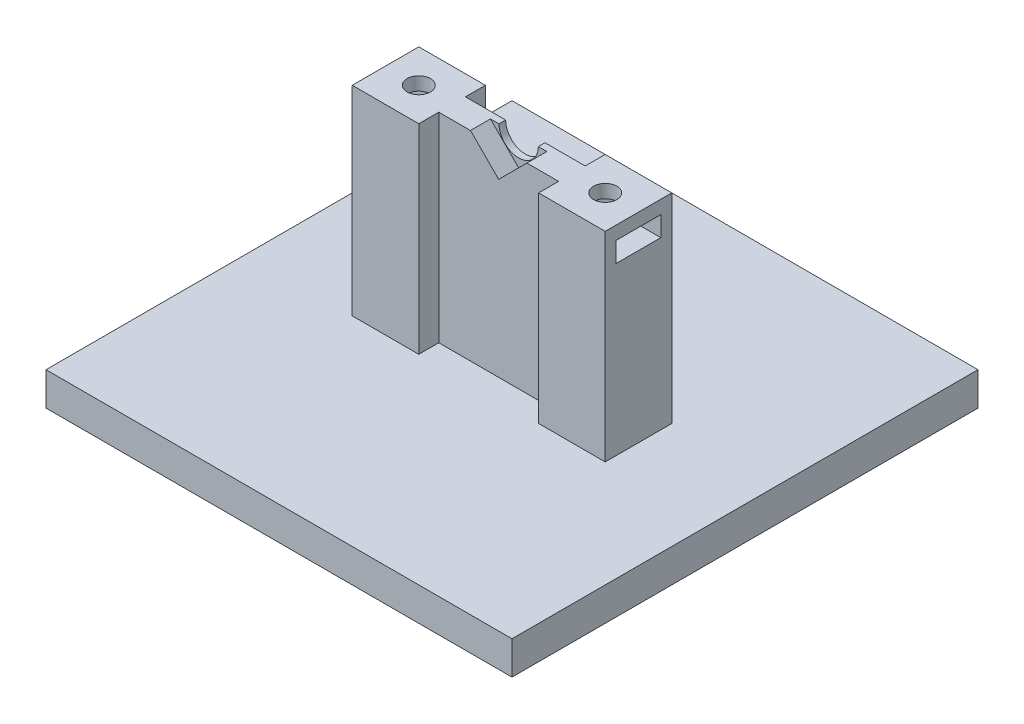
ISO-10303-21;
HEADER;
FILE_DESCRIPTION(('STEP AP214'),'2;1');
FILE_NAME('part.step','',(''),(''),'','','');
FILE_SCHEMA(('AUTOMOTIVE_DESIGN { 1 0 10303 214 1 1 1 1 }'));
ENDSEC;
DATA;
#1=APPLICATION_CONTEXT('core data for automotive mechanical design processes');
#2=APPLICATION_PROTOCOL_DEFINITION('international standard','automotive_design',2000,#1);
#3=PRODUCT_CONTEXT('',#1,'mechanical');
#4=PRODUCT('Part','Part','',(#3));
#5=PRODUCT_RELATED_PRODUCT_CATEGORY('part','',(#4));
#6=PRODUCT_DEFINITION_FORMATION('','',#4);
#7=PRODUCT_DEFINITION_CONTEXT('part definition',#1,'design');
#8=PRODUCT_DEFINITION('design','',#6,#7);
#9=PRODUCT_DEFINITION_SHAPE('','',#8);
#10=(LENGTH_UNIT() NAMED_UNIT(*) SI_UNIT(.MILLI.,.METRE.));
#11=(NAMED_UNIT(*) PLANE_ANGLE_UNIT() SI_UNIT($,.RADIAN.));
#12=(NAMED_UNIT(*) SI_UNIT($,.STERADIAN.) SOLID_ANGLE_UNIT());
#13=UNCERTAINTY_MEASURE_WITH_UNIT(LENGTH_MEASURE(1.E-05),#10,'distance_accuracy_value','');
#14=(GEOMETRIC_REPRESENTATION_CONTEXT(3) GLOBAL_UNCERTAINTY_ASSIGNED_CONTEXT((#13)) GLOBAL_UNIT_ASSIGNED_CONTEXT((#10,
#11,#12)) REPRESENTATION_CONTEXT('',''));
#15=CARTESIAN_POINT('',(0.,0.,0.));
#16=DIRECTION('',(0.,0.,1.));
#17=DIRECTION('',(1.,0.,0.));
#18=AXIS2_PLACEMENT_3D('',#15,#16,#17);
#19=CARTESIAN_POINT('',(0.,35.,0.));
#20=DIRECTION('',(0.,1.,0.));
#21=DIRECTION('',(0.,0.,1.));
#22=AXIS2_PLACEMENT_3D('',#19,#20,#21);
#23=PLANE('',#22);
#24=CARTESIAN_POINT('',(-14.,35.,0.));
#25=DIRECTION('',(0.,1.,0.));
#26=DIRECTION('',(0.,0.,1.));
#27=AXIS2_PLACEMENT_3D('',#24,#25,#26);
#28=CIRCLE('',#27,1.75);
#29=CARTESIAN_POINT('',(-14.,35.,1.75));
#30=VERTEX_POINT('',#29);
#31=EDGE_CURVE('E662',#30,#30,#28,.T.);
#32=ORIENTED_EDGE('',*,*,#31,.F.);
#33=EDGE_LOOP('',(#32));
#34=FACE_BOUND('',#33,.T.);
#35=DIRECTION('',(0.,0.,1.));
#36=VECTOR('',#35,1.);
#37=CARTESIAN_POINT('',(-2.95,35.,-35.));
#38=LINE('',#37,#36);
#39=CARTESIAN_POINT('',(-2.95,35.,-2.));
#40=VERTEX_POINT('',#39);
#41=CARTESIAN_POINT('',(-2.95,35.,-1.));
#42=VERTEX_POINT('',#41);
#43=EDGE_CURVE('E310',#40,#42,#38,.T.);
#44=ORIENTED_EDGE('',*,*,#43,.F.);
#45=DIRECTION('',(1.,0.,0.));
#46=VECTOR('',#45,1.);
#47=CARTESIAN_POINT('',(0.,35.,-2.));
#48=LINE('',#47,#46);
#49=CARTESIAN_POINT('',(-9.00000000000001,35.,-2.));
#50=VERTEX_POINT('',#49);
#51=EDGE_CURVE('E380',#50,#40,#48,.T.);
#52=ORIENTED_EDGE('',*,*,#51,.F.);
#53=DIRECTION('',(0.,0.,-1.));
#54=VECTOR('',#53,1.);
#55=CARTESIAN_POINT('',(-9.00000000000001,35.,0.));
#56=LINE('',#55,#54);
#57=CARTESIAN_POINT('',(-9.00000000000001,35.,-5.));
#58=VERTEX_POINT('',#57);
#59=EDGE_CURVE('E360',#50,#58,#56,.T.);
#60=ORIENTED_EDGE('',*,*,#59,.T.);
#61=DIRECTION('',(-1.,0.,0.));
#62=VECTOR('',#61,1.);
#63=CARTESIAN_POINT('',(0.,35.,-5.00000000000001));
#64=LINE('',#63,#62);
#65=CARTESIAN_POINT('',(-19.,35.,-5.));
#66=VERTEX_POINT('',#65);
#67=EDGE_CURVE('E385',#58,#66,#64,.T.);
#68=ORIENTED_EDGE('',*,*,#67,.T.);
#69=DIRECTION('',(0.,0.,-1.));
#70=VECTOR('',#69,1.);
#71=CARTESIAN_POINT('',(-19.,35.,0.));
#72=LINE('',#71,#70);
#73=CARTESIAN_POINT('',(-19.,35.,5.));
#74=VERTEX_POINT('',#73);
#75=EDGE_CURVE('E347',#74,#66,#72,.T.);
#76=ORIENTED_EDGE('',*,*,#75,.F.);
#77=DIRECTION('',(-1.,0.,0.));
#78=VECTOR('',#77,1.);
#79=CARTESIAN_POINT('',(0.,35.,5.00000000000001));
#80=LINE('',#79,#78);
#81=CARTESIAN_POINT('',(-9.00000000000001,35.,5.));
#82=VERTEX_POINT('',#81);
#83=EDGE_CURVE('E351',#82,#74,#80,.T.);
#84=ORIENTED_EDGE('',*,*,#83,.F.);
#85=CARTESIAN_POINT('',(-9.00000000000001,35.,2.));
#86=VERTEX_POINT('',#85);
#87=EDGE_CURVE('E356',#82,#86,#56,.T.);
#88=ORIENTED_EDGE('',*,*,#87,.T.);
#89=DIRECTION('',(1.,0.,0.));
#90=VECTOR('',#89,1.);
#91=CARTESIAN_POINT('',(0.,35.,2.));
#92=LINE('',#91,#90);
#93=CARTESIAN_POINT('',(-4.24264068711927,35.,2.));
#94=VERTEX_POINT('',#93);
#95=EDGE_CURVE('E361',#86,#94,#92,.T.);
#96=ORIENTED_EDGE('',*,*,#95,.T.);
#97=DIRECTION('',(0.,0.,1.));
#98=VECTOR('',#97,1.);
#99=CARTESIAN_POINT('',(-4.24264068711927,35.,-1.));
#100=LINE('',#99,#98);
#101=CARTESIAN_POINT('',(-4.24264068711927,35.,-1.));
#102=VERTEX_POINT('',#101);
#103=EDGE_CURVE('E341',#102,#94,#100,.T.);
#104=ORIENTED_EDGE('',*,*,#103,.F.);
#105=DIRECTION('',(-1.,0.,0.));
#106=VECTOR('',#105,1.);
#107=CARTESIAN_POINT('',(0.,35.,-1.));
#108=LINE('',#107,#106);
#109=EDGE_CURVE('E321',#42,#102,#108,.T.);
#110=ORIENTED_EDGE('',*,*,#109,.F.);
#111=EDGE_LOOP('',(#44,#52,#60,#68,#76,#84,#88,#96,#104,#110));
#112=FACE_BOUND('',#111,.T.);
#113=ADVANCED_FACE('F49',(#34,#112),#23,.T.);
#114=CARTESIAN_POINT('',(-35.,5.,35.));
#115=DIRECTION('',(1.,0.,0.));
#116=DIRECTION('',(0.,0.,-1.));
#117=AXIS2_PLACEMENT_3D('',#114,#115,#116);
#118=PLANE('',#117);
#119=DIRECTION('',(0.,0.,1.));
#120=VECTOR('',#119,1.);
#121=CARTESIAN_POINT('',(-35.,0.,35.));
#122=LINE('',#121,#120);
#123=CARTESIAN_POINT('',(-35.,0.,-35.));
#124=VERTEX_POINT('',#123);
#125=CARTESIAN_POINT('',(-35.,0.,35.));
#126=VERTEX_POINT('',#125);
#127=EDGE_CURVE('E464',#124,#126,#122,.T.);
#128=ORIENTED_EDGE('',*,*,#127,.T.);
#129=DIRECTION('',(0.,-1.,0.));
#130=VECTOR('',#129,1.);
#131=CARTESIAN_POINT('',(-35.,5.,35.));
#132=LINE('',#131,#130);
#133=CARTESIAN_POINT('',(-35.,5.,35.));
#134=VERTEX_POINT('',#133);
#135=EDGE_CURVE('E58',#134,#126,#132,.T.);
#136=ORIENTED_EDGE('',*,*,#135,.F.);
#137=DIRECTION('',(0.,0.,1.));
#138=VECTOR('',#137,1.);
#139=CARTESIAN_POINT('',(-35.,5.,35.));
#140=LINE('',#139,#138);
#141=CARTESIAN_POINT('',(-35.,5.,-35.));
#142=VERTEX_POINT('',#141);
#143=EDGE_CURVE('E465',#142,#134,#140,.T.);
#144=ORIENTED_EDGE('',*,*,#143,.F.);
#145=DIRECTION('',(0.,-1.,0.));
#146=VECTOR('',#145,1.);
#147=CARTESIAN_POINT('',(-35.,5.,-35.));
#148=LINE('',#147,#146);
#149=EDGE_CURVE('E479',#142,#124,#148,.T.);
#150=ORIENTED_EDGE('',*,*,#149,.T.);
#151=EDGE_LOOP('',(#128,#136,#144,#150));
#152=FACE_BOUND('',#151,.T.);
#153=ADVANCED_FACE('F51',(#152),#118,.F.);
#154=CARTESIAN_POINT('',(35.,5.,35.));
#155=DIRECTION('',(0.,0.,-1.));
#156=DIRECTION('',(-1.,0.,0.));
#157=AXIS2_PLACEMENT_3D('',#154,#155,#156);
#158=PLANE('',#157);
#159=DIRECTION('',(1.,0.,0.));
#160=VECTOR('',#159,1.);
#161=CARTESIAN_POINT('',(35.,0.,35.));
#162=LINE('',#161,#160);
#163=CARTESIAN_POINT('',(35.,0.,35.));
#164=VERTEX_POINT('',#163);
#165=EDGE_CURVE('E483',#126,#164,#162,.T.);
#166=ORIENTED_EDGE('',*,*,#165,.T.);
#167=DIRECTION('',(0.,-1.,0.));
#168=VECTOR('',#167,1.);
#169=CARTESIAN_POINT('',(35.,5.,35.));
#170=LINE('',#169,#168);
#171=CARTESIAN_POINT('',(35.,5.,35.));
#172=VERTEX_POINT('',#171);
#173=EDGE_CURVE('E498',#172,#164,#170,.T.);
#174=ORIENTED_EDGE('',*,*,#173,.F.);
#175=DIRECTION('',(1.,0.,0.));
#176=VECTOR('',#175,1.);
#177=CARTESIAN_POINT('',(35.,5.,35.));
#178=LINE('',#177,#176);
#179=EDGE_CURVE('E469',#134,#172,#178,.T.);
#180=ORIENTED_EDGE('',*,*,#179,.F.);
#181=ORIENTED_EDGE('',*,*,#135,.T.);
#182=EDGE_LOOP('',(#166,#174,#180,#181));
#183=FACE_BOUND('',#182,.T.);
#184=ADVANCED_FACE('F505',(#183),#158,.F.);
#185=CARTESIAN_POINT('',(35.,5.,35.));
#186=DIRECTION('',(-1.,0.,0.));
#187=DIRECTION('',(0.,0.,1.));
#188=AXIS2_PLACEMENT_3D('',#185,#186,#187);
#189=PLANE('',#188);
#190=DIRECTION('',(0.,0.,-1.));
#191=VECTOR('',#190,1.);
#192=CARTESIAN_POINT('',(35.,0.,35.));
#193=LINE('',#192,#191);
#194=CARTESIAN_POINT('',(35.,0.,-35.));
#195=VERTEX_POINT('',#194);
#196=EDGE_CURVE('E486',#164,#195,#193,.T.);
#197=ORIENTED_EDGE('',*,*,#196,.T.);
#198=DIRECTION('',(0.,-1.,0.));
#199=VECTOR('',#198,1.);
#200=CARTESIAN_POINT('',(35.,5.,-35.));
#201=LINE('',#200,#199);
#202=CARTESIAN_POINT('',(35.,5.,-35.));
#203=VERTEX_POINT('',#202);
#204=EDGE_CURVE('E494',#203,#195,#201,.T.);
#205=ORIENTED_EDGE('',*,*,#204,.F.);
#206=DIRECTION('',(0.,0.,-1.));
#207=VECTOR('',#206,1.);
#208=CARTESIAN_POINT('',(35.,5.,35.));
#209=LINE('',#208,#207);
#210=EDGE_CURVE('E473',#172,#203,#209,.T.);
#211=ORIENTED_EDGE('',*,*,#210,.F.);
#212=ORIENTED_EDGE('',*,*,#173,.T.);
#213=EDGE_LOOP('',(#197,#205,#211,#212));
#214=FACE_BOUND('',#213,.T.);
#215=ADVANCED_FACE('F517',(#214),#189,.F.);
#216=CARTESIAN_POINT('',(35.,5.,-35.));
#217=DIRECTION('',(0.,0.,1.));
#218=DIRECTION('',(1.,0.,0.));
#219=AXIS2_PLACEMENT_3D('',#216,#217,#218);
#220=PLANE('',#219);
#221=DIRECTION('',(-1.,0.,0.));
#222=VECTOR('',#221,1.);
#223=CARTESIAN_POINT('',(35.,0.,-35.));
#224=LINE('',#223,#222);
#225=EDGE_CURVE('E470',#195,#124,#224,.T.);
#226=ORIENTED_EDGE('',*,*,#225,.T.);
#227=ORIENTED_EDGE('',*,*,#149,.F.);
#228=DIRECTION('',(-1.,0.,0.));
#229=VECTOR('',#228,1.);
#230=CARTESIAN_POINT('',(35.,5.,-35.));
#231=LINE('',#230,#229);
#232=EDGE_CURVE('E476',#203,#142,#231,.T.);
#233=ORIENTED_EDGE('',*,*,#232,.F.);
#234=ORIENTED_EDGE('',*,*,#204,.T.);
#235=EDGE_LOOP('',(#226,#227,#233,#234));
#236=FACE_BOUND('',#235,.T.);
#237=ADVANCED_FACE('F521',(#236),#220,.F.);
#238=CARTESIAN_POINT('',(0.,5.,0.));
#239=DIRECTION('',(0.,1.,0.));
#240=DIRECTION('',(0.,0.,1.));
#241=AXIS2_PLACEMENT_3D('',#238,#239,#240);
#242=PLANE('',#241);
#243=DIRECTION('',(0.,0.,-1.));
#244=VECTOR('',#243,1.);
#245=CARTESIAN_POINT('',(-19.,5.,0.));
#246=LINE('',#245,#244);
#247=CARTESIAN_POINT('',(-19.,5.,5.));
#248=VERTEX_POINT('',#247);
#249=CARTESIAN_POINT('',(-19.,5.,-5.));
#250=VERTEX_POINT('',#249);
#251=EDGE_CURVE('E340',#248,#250,#246,.T.);
#252=ORIENTED_EDGE('',*,*,#251,.T.);
#253=DIRECTION('',(-1.,0.,0.));
#254=VECTOR('',#253,1.);
#255=CARTESIAN_POINT('',(0.,5.,-5.00000000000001));
#256=LINE('',#255,#254);
#257=CARTESIAN_POINT('',(-9.00000000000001,5.,-5.));
#258=VERTEX_POINT('',#257);
#259=EDGE_CURVE('E352',#258,#250,#256,.T.);
#260=ORIENTED_EDGE('',*,*,#259,.F.);
#261=DIRECTION('',(0.,0.,-1.));
#262=VECTOR('',#261,1.);
#263=CARTESIAN_POINT('',(-9.00000000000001,5.,0.));
#264=LINE('',#263,#262);
#265=CARTESIAN_POINT('',(-9.00000000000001,5.,-2.));
#266=VERTEX_POINT('',#265);
#267=EDGE_CURVE('E400',#266,#258,#264,.T.);
#268=ORIENTED_EDGE('',*,*,#267,.F.);
#269=DIRECTION('',(1.,0.,0.));
#270=VECTOR('',#269,1.);
#271=CARTESIAN_POINT('',(0.,5.,-2.));
#272=LINE('',#271,#270);
#273=CARTESIAN_POINT('',(8.99999999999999,5.,-2.));
#274=VERTEX_POINT('',#273);
#275=EDGE_CURVE('E420',#266,#274,#272,.T.);
#276=ORIENTED_EDGE('',*,*,#275,.T.);
#277=DIRECTION('',(0.,0.,-1.));
#278=VECTOR('',#277,1.);
#279=CARTESIAN_POINT('',(8.99999999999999,5.,0.));
#280=LINE('',#279,#278);
#281=CARTESIAN_POINT('',(8.99999999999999,5.,-5.));
#282=VERTEX_POINT('',#281);
#283=EDGE_CURVE('E409',#274,#282,#280,.T.);
#284=ORIENTED_EDGE('',*,*,#283,.T.);
#285=DIRECTION('',(1.,0.,0.));
#286=VECTOR('',#285,1.);
#287=CARTESIAN_POINT('',(0.,5.,-5.00000000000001));
#288=LINE('',#287,#286);
#289=CARTESIAN_POINT('',(19.,5.,-5.));
#290=VERTEX_POINT('',#289);
#291=EDGE_CURVE('E416',#282,#290,#288,.T.);
#292=ORIENTED_EDGE('',*,*,#291,.T.);
#293=DIRECTION('',(0.,0.,-1.));
#294=VECTOR('',#293,1.);
#295=CARTESIAN_POINT('',(19.,5.,0.));
#296=LINE('',#295,#294);
#297=CARTESIAN_POINT('',(19.,5.,5.));
#298=VERTEX_POINT('',#297);
#299=EDGE_CURVE('E412',#298,#290,#296,.T.);
#300=ORIENTED_EDGE('',*,*,#299,.F.);
#301=DIRECTION('',(1.,0.,0.));
#302=VECTOR('',#301,1.);
#303=CARTESIAN_POINT('',(0.,5.,5.));
#304=LINE('',#303,#302);
#305=CARTESIAN_POINT('',(8.99999999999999,5.,5.));
#306=VERTEX_POINT('',#305);
#307=EDGE_CURVE('E408',#306,#298,#304,.T.);
#308=ORIENTED_EDGE('',*,*,#307,.F.);
#309=CARTESIAN_POINT('',(8.99999999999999,5.,2.));
#310=VERTEX_POINT('',#309);
#311=EDGE_CURVE('E404',#306,#310,#280,.T.);
#312=ORIENTED_EDGE('',*,*,#311,.T.);
#313=DIRECTION('',(1.,0.,0.));
#314=VECTOR('',#313,1.);
#315=CARTESIAN_POINT('',(0.,5.,2.));
#316=LINE('',#315,#314);
#317=CARTESIAN_POINT('',(-9.00000000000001,5.,2.));
#318=VERTEX_POINT('',#317);
#319=EDGE_CURVE('E399',#318,#310,#316,.T.);
#320=ORIENTED_EDGE('',*,*,#319,.F.);
#321=CARTESIAN_POINT('',(-9.00000000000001,5.,5.));
#322=VERTEX_POINT('',#321);
#323=EDGE_CURVE('E396',#322,#318,#264,.T.);
#324=ORIENTED_EDGE('',*,*,#323,.F.);
#325=DIRECTION('',(-1.,0.,0.));
#326=VECTOR('',#325,1.);
#327=CARTESIAN_POINT('',(0.,5.,5.00000000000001));
#328=LINE('',#327,#326);
#329=EDGE_CURVE('E392',#322,#248,#328,.T.);
#330=ORIENTED_EDGE('',*,*,#329,.T.);
#331=EDGE_LOOP('',(#252,#260,#268,#276,#284,#292,#300,#308,#312,#320,#324,#330));
#332=FACE_BOUND('',#331,.T.);
#333=ORIENTED_EDGE('',*,*,#143,.T.);
#334=ORIENTED_EDGE('',*,*,#179,.T.);
#335=ORIENTED_EDGE('',*,*,#210,.T.);
#336=ORIENTED_EDGE('',*,*,#232,.T.);
#337=EDGE_LOOP('',(#333,#334,#335,#336));
#338=FACE_BOUND('',#337,.T.);
#339=ADVANCED_FACE('F523',(#332,#338),#242,.T.);
#340=CARTESIAN_POINT('',(0.,0.,0.));
#341=DIRECTION('',(0.,1.,0.));
#342=DIRECTION('',(0.,0.,1.));
#343=AXIS2_PLACEMENT_3D('',#340,#341,#342);
#344=PLANE('',#343);
#345=CARTESIAN_POINT('',(-14.,0.,0.));
#346=DIRECTION('',(0.,1.,0.));
#347=DIRECTION('',(0.,0.,1.));
#348=AXIS2_PLACEMENT_3D('',#345,#346,#347);
#349=CIRCLE('',#348,1.75);
#350=CARTESIAN_POINT('',(-14.,0.,1.75));
#351=VERTEX_POINT('',#350);
#352=EDGE_CURVE('E659',#351,#351,#349,.T.);
#353=ORIENTED_EDGE('',*,*,#352,.T.);
#354=EDGE_LOOP('',(#353));
#355=FACE_BOUND('',#354,.T.);
#356=CARTESIAN_POINT('',(14.,0.,0.));
#357=DIRECTION('',(0.,1.,0.));
#358=DIRECTION('',(0.,0.,1.));
#359=AXIS2_PLACEMENT_3D('',#356,#357,#358);
#360=CIRCLE('',#359,1.75);
#361=CARTESIAN_POINT('',(14.,0.,1.75));
#362=VERTEX_POINT('',#361);
#363=EDGE_CURVE('E663',#362,#362,#360,.T.);
#364=ORIENTED_EDGE('',*,*,#363,.T.);
#365=EDGE_LOOP('',(#364));
#366=FACE_BOUND('',#365,.T.);
#367=ORIENTED_EDGE('',*,*,#127,.F.);
#368=ORIENTED_EDGE('',*,*,#225,.F.);
#369=ORIENTED_EDGE('',*,*,#196,.F.);
#370=ORIENTED_EDGE('',*,*,#165,.F.);
#371=EDGE_LOOP('',(#367,#368,#369,#370));
#372=FACE_BOUND('',#371,.T.);
#373=ADVANCED_FACE('F513',(#355,#366,#372),#344,.F.);
#374=CARTESIAN_POINT('',(-19.,35.,0.));
#375=DIRECTION('',(-1.,0.,0.));
#376=DIRECTION('',(0.,0.,1.));
#377=AXIS2_PLACEMENT_3D('',#374,#375,#376);
#378=PLANE('',#377);
#379=DIRECTION('',(0.,-1.,0.));
#380=VECTOR('',#379,1.);
#381=CARTESIAN_POINT('',(-19.,33.,-3.34863156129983));
#382=LINE('',#381,#380);
#383=CARTESIAN_POINT('',(-19.,33.,-3.34863156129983));
#384=VERTEX_POINT('',#383);
#385=CARTESIAN_POINT('',(-19.,30.,-3.34863156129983));
#386=VERTEX_POINT('',#385);
#387=EDGE_CURVE('E73',#384,#386,#382,.T.);
#388=ORIENTED_EDGE('',*,*,#387,.F.);
#389=DIRECTION('',(0.,0.,-1.));
#390=VECTOR('',#389,1.);
#391=CARTESIAN_POINT('',(-19.,33.,-3.34863156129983));
#392=LINE('',#391,#390);
#393=CARTESIAN_POINT('',(-19.,33.,3.34863156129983));
#394=VERTEX_POINT('',#393);
#395=EDGE_CURVE('E678',#394,#384,#392,.T.);
#396=ORIENTED_EDGE('',*,*,#395,.F.);
#397=DIRECTION('',(0.,1.,0.));
#398=VECTOR('',#397,1.);
#399=CARTESIAN_POINT('',(-19.,33.,3.34863156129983));
#400=LINE('',#399,#398);
#401=CARTESIAN_POINT('',(-19.,30.,3.34863156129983));
#402=VERTEX_POINT('',#401);
#403=EDGE_CURVE('E689',#402,#394,#400,.T.);
#404=ORIENTED_EDGE('',*,*,#403,.F.);
#405=DIRECTION('',(0.,0.,1.));
#406=VECTOR('',#405,1.);
#407=CARTESIAN_POINT('',(-19.,30.,-3.34863156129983));
#408=LINE('',#407,#406);
#409=EDGE_CURVE('E693',#386,#402,#408,.T.);
#410=ORIENTED_EDGE('',*,*,#409,.F.);
#411=EDGE_LOOP('',(#388,#396,#404,#410));
#412=FACE_BOUND('',#411,.T.);
#413=ORIENTED_EDGE('',*,*,#251,.F.);
#414=DIRECTION('',(0.,-1.,0.));
#415=VECTOR('',#414,1.);
#416=CARTESIAN_POINT('',(-19.,35.,5.));
#417=LINE('',#416,#415);
#418=EDGE_CURVE('E461',#74,#248,#417,.T.);
#419=ORIENTED_EDGE('',*,*,#418,.F.);
#420=ORIENTED_EDGE('',*,*,#75,.T.);
#421=DIRECTION('',(0.,-1.,0.));
#422=VECTOR('',#421,1.);
#423=CARTESIAN_POINT('',(-19.,35.,-5.));
#424=LINE('',#423,#422);
#425=EDGE_CURVE('E388',#66,#250,#424,.T.);
#426=ORIENTED_EDGE('',*,*,#425,.T.);
#427=EDGE_LOOP('',(#413,#419,#420,#426));
#428=FACE_BOUND('',#427,.T.);
#429=ADVANCED_FACE('F532',(#412,#428),#378,.T.);
#430=CARTESIAN_POINT('',(0.,35.,5.00000000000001));
#431=DIRECTION('',(0.,0.,1.));
#432=DIRECTION('',(1.,0.,0.));
#433=AXIS2_PLACEMENT_3D('',#430,#431,#432);
#434=PLANE('',#433);
#435=ORIENTED_EDGE('',*,*,#329,.F.);
#436=DIRECTION('',(0.,-1.,0.));
#437=VECTOR('',#436,1.);
#438=CARTESIAN_POINT('',(-9.00000000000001,35.,5.));
#439=LINE('',#438,#437);
#440=EDGE_CURVE('E458',#82,#322,#439,.T.);
#441=ORIENTED_EDGE('',*,*,#440,.F.);
#442=ORIENTED_EDGE('',*,*,#83,.T.);
#443=ORIENTED_EDGE('',*,*,#418,.T.);
#444=EDGE_LOOP('',(#435,#441,#442,#443));
#445=FACE_BOUND('',#444,.T.);
#446=ADVANCED_FACE('F840',(#445),#434,.T.);
#447=CARTESIAN_POINT('',(-9.00000000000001,35.,0.));
#448=DIRECTION('',(-1.,0.,0.));
#449=DIRECTION('',(0.,0.,1.));
#450=AXIS2_PLACEMENT_3D('',#447,#448,#449);
#451=PLANE('',#450);
#452=ORIENTED_EDGE('',*,*,#323,.T.);
#453=DIRECTION('',(0.,-1.,0.));
#454=VECTOR('',#453,1.);
#455=CARTESIAN_POINT('',(-9.00000000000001,35.,2.));
#456=LINE('',#455,#454);
#457=EDGE_CURVE('E454',#86,#318,#456,.T.);
#458=ORIENTED_EDGE('',*,*,#457,.F.);
#459=ORIENTED_EDGE('',*,*,#87,.F.);
#460=ORIENTED_EDGE('',*,*,#440,.T.);
#461=EDGE_LOOP('',(#452,#458,#459,#460));
#462=FACE_BOUND('',#461,.T.);
#463=ADVANCED_FACE('F799',(#462),#451,.F.);
#464=CARTESIAN_POINT('',(0.,35.,2.));
#465=DIRECTION('',(0.,0.,-1.));
#466=DIRECTION('',(-1.,0.,0.));
#467=AXIS2_PLACEMENT_3D('',#464,#465,#466);
#468=PLANE('',#467);
#469=CARTESIAN_POINT('',(4.24264068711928,35.,2.));
#470=VERTEX_POINT('',#469);
#471=CARTESIAN_POINT('',(8.99999999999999,35.,2.));
#472=VERTEX_POINT('',#471);
#473=EDGE_CURVE('E359',#470,#472,#92,.T.);
#474=ORIENTED_EDGE('',*,*,#473,.F.);
#475=DIRECTION('',(0.707106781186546,0.707106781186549,0.));
#476=VECTOR('',#475,1.);
#477=CARTESIAN_POINT('',(-15.3786796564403,15.3786796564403,2.));
#478=LINE('',#477,#476);
#479=CARTESIAN_POINT('',(0.,30.7573593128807,2.));
#480=VERTEX_POINT('',#479);
#481=EDGE_CURVE('E317',#480,#470,#478,.T.);
#482=ORIENTED_EDGE('',*,*,#481,.F.);
#483=DIRECTION('',(0.707106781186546,-0.707106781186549,0.));
#484=VECTOR('',#483,1.);
#485=CARTESIAN_POINT('',(15.3786796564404,15.3786796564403,2.));
#486=LINE('',#485,#484);
#487=EDGE_CURVE('E322',#94,#480,#486,.T.);
#488=ORIENTED_EDGE('',*,*,#487,.F.);
#489=ORIENTED_EDGE('',*,*,#95,.F.);
#490=ORIENTED_EDGE('',*,*,#457,.T.);
#491=ORIENTED_EDGE('',*,*,#319,.T.);
#492=DIRECTION('',(0.,-1.,0.));
#493=VECTOR('',#492,1.);
#494=CARTESIAN_POINT('',(8.99999999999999,35.,2.));
#495=LINE('',#494,#493);
#496=EDGE_CURVE('E451',#472,#310,#495,.T.);
#497=ORIENTED_EDGE('',*,*,#496,.F.);
#498=EDGE_LOOP('',(#474,#482,#488,#489,#490,#491,#497));
#499=FACE_BOUND('',#498,.T.);
#500=ADVANCED_FACE('F587',(#499),#468,.F.);
#501=CARTESIAN_POINT('',(8.99999999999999,35.,0.));
#502=DIRECTION('',(-1.,0.,0.));
#503=DIRECTION('',(0.,0.,1.));
#504=AXIS2_PLACEMENT_3D('',#501,#502,#503);
#505=PLANE('',#504);
#506=ORIENTED_EDGE('',*,*,#311,.F.);
#507=DIRECTION('',(0.,-1.,0.));
#508=VECTOR('',#507,1.);
#509=CARTESIAN_POINT('',(8.99999999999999,35.,5.));
#510=LINE('',#509,#508);
#511=CARTESIAN_POINT('',(8.99999999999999,35.,5.));
#512=VERTEX_POINT('',#511);
#513=EDGE_CURVE('E448',#512,#306,#510,.T.);
#514=ORIENTED_EDGE('',*,*,#513,.F.);
#515=DIRECTION('',(0.,0.,-1.));
#516=VECTOR('',#515,1.);
#517=CARTESIAN_POINT('',(8.99999999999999,35.,0.));
#518=LINE('',#517,#516);
#519=EDGE_CURVE('E365',#512,#472,#518,.T.);
#520=ORIENTED_EDGE('',*,*,#519,.T.);
#521=ORIENTED_EDGE('',*,*,#496,.T.);
#522=EDGE_LOOP('',(#506,#514,#520,#521));
#523=FACE_BOUND('',#522,.T.);
#524=ADVANCED_FACE('F806',(#523),#505,.T.);
#525=CARTESIAN_POINT('',(0.,35.,5.));
#526=DIRECTION('',(0.,0.,-1.));
#527=DIRECTION('',(-1.,0.,0.));
#528=AXIS2_PLACEMENT_3D('',#525,#526,#527);
#529=PLANE('',#528);
#530=ORIENTED_EDGE('',*,*,#307,.T.);
#531=DIRECTION('',(0.,-1.,0.));
#532=VECTOR('',#531,1.);
#533=CARTESIAN_POINT('',(19.,35.,5.));
#534=LINE('',#533,#532);
#535=CARTESIAN_POINT('',(19.,35.,5.));
#536=VERTEX_POINT('',#535);
#537=EDGE_CURVE('E444',#536,#298,#534,.T.);
#538=ORIENTED_EDGE('',*,*,#537,.F.);
#539=DIRECTION('',(1.,0.,0.));
#540=VECTOR('',#539,1.);
#541=CARTESIAN_POINT('',(0.,35.,5.));
#542=LINE('',#541,#540);
#543=EDGE_CURVE('E369',#512,#536,#542,.T.);
#544=ORIENTED_EDGE('',*,*,#543,.F.);
#545=ORIENTED_EDGE('',*,*,#513,.T.);
#546=EDGE_LOOP('',(#530,#538,#544,#545));
#547=FACE_BOUND('',#546,.T.);
#548=ADVANCED_FACE('F813',(#547),#529,.F.);
#549=CARTESIAN_POINT('',(19.,35.,0.));
#550=DIRECTION('',(-1.,0.,0.));
#551=DIRECTION('',(0.,0.,1.));
#552=AXIS2_PLACEMENT_3D('',#549,#550,#551);
#553=PLANE('',#552);
#554=DIRECTION('',(0.,0.,-1.));
#555=VECTOR('',#554,1.);
#556=CARTESIAN_POINT('',(19.,30.,3.34863156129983));
#557=LINE('',#556,#555);
#558=CARTESIAN_POINT('',(19.,30.,3.34863156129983));
#559=VERTEX_POINT('',#558);
#560=CARTESIAN_POINT('',(19.,30.,-3.34863156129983));
#561=VERTEX_POINT('',#560);
#562=EDGE_CURVE('E714',#559,#561,#557,.T.);
#563=ORIENTED_EDGE('',*,*,#562,.F.);
#564=DIRECTION('',(0.,-1.,0.));
#565=VECTOR('',#564,1.);
#566=CARTESIAN_POINT('',(19.,33.,3.34863156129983));
#567=LINE('',#566,#565);
#568=CARTESIAN_POINT('',(19.,33.,3.34863156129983));
#569=VERTEX_POINT('',#568);
#570=EDGE_CURVE('E65',#569,#559,#567,.T.);
#571=ORIENTED_EDGE('',*,*,#570,.F.);
#572=DIRECTION('',(0.,0.,1.));
#573=VECTOR('',#572,1.);
#574=CARTESIAN_POINT('',(19.,33.,3.34863156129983));
#575=LINE('',#574,#573);
#576=CARTESIAN_POINT('',(19.,33.,-3.34863156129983));
#577=VERTEX_POINT('',#576);
#578=EDGE_CURVE('E273',#577,#569,#575,.T.);
#579=ORIENTED_EDGE('',*,*,#578,.F.);
#580=DIRECTION('',(0.,1.,0.));
#581=VECTOR('',#580,1.);
#582=CARTESIAN_POINT('',(19.,33.,-3.34863156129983));
#583=LINE('',#582,#581);
#584=EDGE_CURVE('E710',#561,#577,#583,.T.);
#585=ORIENTED_EDGE('',*,*,#584,.F.);
#586=EDGE_LOOP('',(#563,#571,#579,#585));
#587=FACE_BOUND('',#586,.T.);
#588=ORIENTED_EDGE('',*,*,#299,.T.);
#589=DIRECTION('',(0.,-1.,0.));
#590=VECTOR('',#589,1.);
#591=CARTESIAN_POINT('',(19.,35.,-5.));
#592=LINE('',#591,#590);
#593=CARTESIAN_POINT('',(19.,35.,-5.));
#594=VERTEX_POINT('',#593);
#595=EDGE_CURVE('E441',#594,#290,#592,.T.);
#596=ORIENTED_EDGE('',*,*,#595,.F.);
#597=DIRECTION('',(0.,0.,-1.));
#598=VECTOR('',#597,1.);
#599=CARTESIAN_POINT('',(19.,35.,0.));
#600=LINE('',#599,#598);
#601=EDGE_CURVE('E373',#536,#594,#600,.T.);
#602=ORIENTED_EDGE('',*,*,#601,.F.);
#603=ORIENTED_EDGE('',*,*,#537,.T.);
#604=EDGE_LOOP('',(#588,#596,#602,#603));
#605=FACE_BOUND('',#604,.T.);
#606=ADVANCED_FACE('F722',(#587,#605),#553,.F.);
#607=CARTESIAN_POINT('',(0.,35.,-5.00000000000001));
#608=DIRECTION('',(0.,0.,-1.));
#609=DIRECTION('',(-1.,0.,0.));
#610=AXIS2_PLACEMENT_3D('',#607,#608,#609);
#611=PLANE('',#610);
#612=ORIENTED_EDGE('',*,*,#291,.F.);
#613=DIRECTION('',(0.,-1.,0.));
#614=VECTOR('',#613,1.);
#615=CARTESIAN_POINT('',(8.99999999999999,35.,-5.));
#616=LINE('',#615,#614);
#617=CARTESIAN_POINT('',(8.99999999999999,35.,-5.));
#618=VERTEX_POINT('',#617);
#619=EDGE_CURVE('E438',#618,#282,#616,.T.);
#620=ORIENTED_EDGE('',*,*,#619,.F.);
#621=DIRECTION('',(1.,0.,0.));
#622=VECTOR('',#621,1.);
#623=CARTESIAN_POINT('',(0.,35.,-5.00000000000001));
#624=LINE('',#623,#622);
#625=EDGE_CURVE('E376',#618,#594,#624,.T.);
#626=ORIENTED_EDGE('',*,*,#625,.T.);
#627=ORIENTED_EDGE('',*,*,#595,.T.);
#628=EDGE_LOOP('',(#612,#620,#626,#627));
#629=FACE_BOUND('',#628,.T.);
#630=ADVANCED_FACE('F816',(#629),#611,.T.);
#631=ORIENTED_EDGE('',*,*,#283,.F.);
#632=DIRECTION('',(0.,-1.,0.));
#633=VECTOR('',#632,1.);
#634=CARTESIAN_POINT('',(8.99999999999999,35.,-2.));
#635=LINE('',#634,#633);
#636=CARTESIAN_POINT('',(8.99999999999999,35.,-2.));
#637=VERTEX_POINT('',#636);
#638=EDGE_CURVE('E435',#637,#274,#635,.T.);
#639=ORIENTED_EDGE('',*,*,#638,.F.);
#640=EDGE_CURVE('E370',#637,#618,#518,.T.);
#641=ORIENTED_EDGE('',*,*,#640,.T.);
#642=ORIENTED_EDGE('',*,*,#619,.T.);
#643=EDGE_LOOP('',(#631,#639,#641,#642));
#644=FACE_BOUND('',#643,.T.);
#645=ADVANCED_FACE('F821',(#644),#505,.T.);
#646=CARTESIAN_POINT('',(0.,35.,-2.));
#647=DIRECTION('',(0.,0.,-1.));
#648=DIRECTION('',(-1.,0.,0.));
#649=AXIS2_PLACEMENT_3D('',#646,#647,#648);
#650=PLANE('',#649);
#651=CARTESIAN_POINT('',(0.,35.,-2.));
#652=DIRECTION('',(0.,0.,-1.));
#653=DIRECTION('',(-1.,0.,0.));
#654=AXIS2_PLACEMENT_3D('',#651,#652,#653);
#655=CIRCLE('',#654,2.95);
#656=CARTESIAN_POINT('',(2.95000000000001,35.,-2.));
#657=VERTEX_POINT('',#656);
#658=EDGE_CURVE('E314',#657,#40,#655,.T.);
#659=ORIENTED_EDGE('',*,*,#658,.F.);
#660=EDGE_CURVE('E384',#657,#637,#48,.T.);
#661=ORIENTED_EDGE('',*,*,#660,.T.);
#662=ORIENTED_EDGE('',*,*,#638,.T.);
#663=ORIENTED_EDGE('',*,*,#275,.F.);
#664=DIRECTION('',(0.,-1.,0.));
#665=VECTOR('',#664,1.);
#666=CARTESIAN_POINT('',(-9.00000000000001,35.,-2.));
#667=LINE('',#666,#665);
#668=EDGE_CURVE('E432',#50,#266,#667,.T.);
#669=ORIENTED_EDGE('',*,*,#668,.F.);
#670=ORIENTED_EDGE('',*,*,#51,.T.);
#671=EDGE_LOOP('',(#659,#661,#662,#663,#669,#670));
#672=FACE_BOUND('',#671,.T.);
#673=ADVANCED_FACE('F825',(#672),#650,.T.);
#674=ORIENTED_EDGE('',*,*,#267,.T.);
#675=DIRECTION('',(0.,-1.,0.));
#676=VECTOR('',#675,1.);
#677=CARTESIAN_POINT('',(-9.00000000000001,35.,-5.));
#678=LINE('',#677,#676);
#679=EDGE_CURVE('E429',#58,#258,#678,.T.);
#680=ORIENTED_EDGE('',*,*,#679,.F.);
#681=ORIENTED_EDGE('',*,*,#59,.F.);
#682=ORIENTED_EDGE('',*,*,#668,.T.);
#683=EDGE_LOOP('',(#674,#680,#681,#682));
#684=FACE_BOUND('',#683,.T.);
#685=ADVANCED_FACE('F563',(#684),#451,.F.);
#686=CARTESIAN_POINT('',(0.,35.,-5.00000000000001));
#687=DIRECTION('',(0.,0.,1.));
#688=DIRECTION('',(1.,0.,0.));
#689=AXIS2_PLACEMENT_3D('',#686,#687,#688);
#690=PLANE('',#689);
#691=ORIENTED_EDGE('',*,*,#259,.T.);
#692=ORIENTED_EDGE('',*,*,#425,.F.);
#693=ORIENTED_EDGE('',*,*,#67,.F.);
#694=ORIENTED_EDGE('',*,*,#679,.T.);
#695=EDGE_LOOP('',(#691,#692,#693,#694));
#696=FACE_BOUND('',#695,.T.);
#697=ADVANCED_FACE('F553',(#696),#690,.F.);
#698=CARTESIAN_POINT('',(14.,35.,0.));
#699=DIRECTION('',(0.,1.,0.));
#700=DIRECTION('',(0.,0.,1.));
#701=AXIS2_PLACEMENT_3D('',#698,#699,#700);
#702=CIRCLE('',#701,1.75);
#703=CARTESIAN_POINT('',(14.,35.,1.75));
#704=VERTEX_POINT('',#703);
#705=EDGE_CURVE('E568',#704,#704,#702,.T.);
#706=ORIENTED_EDGE('',*,*,#705,.F.);
#707=EDGE_LOOP('',(#706));
#708=FACE_BOUND('',#707,.T.);
#709=DIRECTION('',(0.,0.,1.));
#710=VECTOR('',#709,1.);
#711=CARTESIAN_POINT('',(2.95000000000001,35.,-35.));
#712=LINE('',#711,#710);
#713=CARTESIAN_POINT('',(2.95000000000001,35.,-1.));
#714=VERTEX_POINT('',#713);
#715=EDGE_CURVE('E307',#714,#657,#712,.F.);
#716=ORIENTED_EDGE('',*,*,#715,.F.);
#717=CARTESIAN_POINT('',(4.24264068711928,35.,-1.));
#718=VERTEX_POINT('',#717);
#719=EDGE_CURVE('E323',#718,#714,#108,.T.);
#720=ORIENTED_EDGE('',*,*,#719,.F.);
#721=DIRECTION('',(0.,0.,1.));
#722=VECTOR('',#721,1.);
#723=CARTESIAN_POINT('',(4.24264068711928,35.,-1.));
#724=LINE('',#723,#722);
#725=EDGE_CURVE('E331',#718,#470,#724,.T.);
#726=ORIENTED_EDGE('',*,*,#725,.T.);
#727=ORIENTED_EDGE('',*,*,#473,.T.);
#728=ORIENTED_EDGE('',*,*,#519,.F.);
#729=ORIENTED_EDGE('',*,*,#543,.T.);
#730=ORIENTED_EDGE('',*,*,#601,.T.);
#731=ORIENTED_EDGE('',*,*,#625,.F.);
#732=ORIENTED_EDGE('',*,*,#640,.F.);
#733=ORIENTED_EDGE('',*,*,#660,.F.);
#734=EDGE_LOOP('',(#716,#720,#726,#727,#728,#729,#730,#731,#732,#733));
#735=FACE_BOUND('',#734,.T.);
#736=ADVANCED_FACE('F541',(#708,#735),#23,.T.);
#737=CARTESIAN_POINT('',(-15.3786796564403,15.3786796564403,-1.));
#738=DIRECTION('',(0.707106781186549,-0.707106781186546,0.));
#739=DIRECTION('',(0.707106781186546,0.707106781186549,0.));
#740=AXIS2_PLACEMENT_3D('',#737,#738,#739);
#741=PLANE('',#740);
#742=ORIENTED_EDGE('',*,*,#481,.T.);
#743=ORIENTED_EDGE('',*,*,#725,.F.);
#744=DIRECTION('',(0.707106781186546,0.707106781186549,0.));
#745=VECTOR('',#744,1.);
#746=CARTESIAN_POINT('',(-15.3786796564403,15.3786796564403,-1.));
#747=LINE('',#746,#745);
#748=CARTESIAN_POINT('',(0.,30.7573593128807,-1.));
#749=VERTEX_POINT('',#748);
#750=EDGE_CURVE('E318',#749,#718,#747,.T.);
#751=ORIENTED_EDGE('',*,*,#750,.F.);
#752=DIRECTION('',(0.,0.,1.));
#753=VECTOR('',#752,1.);
#754=CARTESIAN_POINT('',(0.,30.7573593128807,-1.));
#755=LINE('',#754,#753);
#756=EDGE_CURVE('E337',#749,#480,#755,.T.);
#757=ORIENTED_EDGE('',*,*,#756,.T.);
#758=EDGE_LOOP('',(#742,#743,#751,#757));
#759=FACE_BOUND('',#758,.T.);
#760=ADVANCED_FACE('F552',(#759),#741,.F.);
#761=CARTESIAN_POINT('',(15.3786796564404,15.3786796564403,-1.));
#762=DIRECTION('',(-0.707106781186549,-0.707106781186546,0.));
#763=DIRECTION('',(0.707106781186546,-0.707106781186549,0.));
#764=AXIS2_PLACEMENT_3D('',#761,#762,#763);
#765=PLANE('',#764);
#766=ORIENTED_EDGE('',*,*,#487,.T.);
#767=ORIENTED_EDGE('',*,*,#756,.F.);
#768=DIRECTION('',(0.707106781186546,-0.707106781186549,0.));
#769=VECTOR('',#768,1.);
#770=CARTESIAN_POINT('',(15.3786796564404,15.3786796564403,-1.));
#771=LINE('',#770,#769);
#772=EDGE_CURVE('E327',#102,#749,#771,.T.);
#773=ORIENTED_EDGE('',*,*,#772,.F.);
#774=ORIENTED_EDGE('',*,*,#103,.T.);
#775=EDGE_LOOP('',(#766,#767,#773,#774));
#776=FACE_BOUND('',#775,.T.);
#777=ADVANCED_FACE('F560',(#776),#765,.F.);
#778=CARTESIAN_POINT('',(0.,0.,-1.));
#779=DIRECTION('',(0.,0.,1.));
#780=DIRECTION('',(1.,0.,0.));
#781=AXIS2_PLACEMENT_3D('',#778,#779,#780);
#782=PLANE('',#781);
#783=CARTESIAN_POINT('',(0.,35.,-1.));
#784=DIRECTION('',(0.,0.,1.));
#785=DIRECTION('',(1.,0.,0.));
#786=AXIS2_PLACEMENT_3D('',#783,#784,#785);
#787=CIRCLE('',#786,2.95);
#788=EDGE_CURVE('E11',#42,#714,#787,.T.);
#789=ORIENTED_EDGE('',*,*,#788,.F.);
#790=ORIENTED_EDGE('',*,*,#109,.T.);
#791=ORIENTED_EDGE('',*,*,#772,.T.);
#792=ORIENTED_EDGE('',*,*,#750,.T.);
#793=ORIENTED_EDGE('',*,*,#719,.T.);
#794=EDGE_LOOP('',(#789,#790,#791,#792,#793));
#795=FACE_BOUND('',#794,.T.);
#796=ADVANCED_FACE('F577',(#795),#782,.T.);
#797=CARTESIAN_POINT('',(0.,35.,-35.));
#798=DIRECTION('',(0.,0.,1.));
#799=DIRECTION('',(1.,0.,0.));
#800=AXIS2_PLACEMENT_3D('',#797,#798,#799);
#801=CYLINDRICAL_SURFACE('',#800,2.95);
#802=ORIENTED_EDGE('',*,*,#658,.T.);
#803=ORIENTED_EDGE('',*,*,#43,.T.);
#804=ORIENTED_EDGE('',*,*,#788,.T.);
#805=ORIENTED_EDGE('',*,*,#715,.T.);
#806=EDGE_LOOP('',(#802,#803,#804,#805));
#807=FACE_BOUND('',#806,.T.);
#808=ADVANCED_FACE('F744',(#807),#801,.F.);
#809=CARTESIAN_POINT('',(14.,0.,0.));
#810=DIRECTION('',(0.,1.,0.));
#811=DIRECTION('',(0.,0.,1.));
#812=AXIS2_PLACEMENT_3D('',#809,#810,#811);
#813=CYLINDRICAL_SURFACE('',#812,1.75);
#814=ORIENTED_EDGE('',*,*,#705,.T.);
#815=EDGE_LOOP('',(#814));
#816=FACE_BOUND('',#815,.T.);
#817=CARTESIAN_POINT('',(14.,33.,0.));
#818=DIRECTION('',(0.,1.,0.));
#819=DIRECTION('',(0.,0.,1.));
#820=AXIS2_PLACEMENT_3D('',#817,#818,#819);
#821=CIRCLE('',#820,1.75);
#822=CARTESIAN_POINT('',(14.,33.,1.75));
#823=VERTEX_POINT('',#822);
#824=EDGE_CURVE('E655',#823,#823,#821,.T.);
#825=ORIENTED_EDGE('',*,*,#824,.F.);
#826=EDGE_LOOP('',(#825));
#827=FACE_BOUND('',#826,.T.);
#828=ADVANCED_FACE('F741',(#816,#827),#813,.F.);
#829=CARTESIAN_POINT('',(14.,30.,0.));
#830=DIRECTION('',(0.,1.,0.));
#831=DIRECTION('',(0.,0.,1.));
#832=AXIS2_PLACEMENT_3D('',#829,#830,#831);
#833=CIRCLE('',#832,1.75);
#834=CARTESIAN_POINT('',(14.,30.,1.75));
#835=VERTEX_POINT('',#834);
#836=EDGE_CURVE('E651',#835,#835,#833,.T.);
#837=ORIENTED_EDGE('',*,*,#836,.T.);
#838=EDGE_LOOP('',(#837));
#839=FACE_BOUND('',#838,.T.);
#840=ORIENTED_EDGE('',*,*,#363,.F.);
#841=EDGE_LOOP('',(#840));
#842=FACE_BOUND('',#841,.T.);
#843=ADVANCED_FACE('F743',(#839,#842),#813,.F.);
#844=CARTESIAN_POINT('',(-14.,0.,0.));
#845=DIRECTION('',(0.,1.,0.));
#846=DIRECTION('',(0.,0.,1.));
#847=AXIS2_PLACEMENT_3D('',#844,#845,#846);
#848=CYLINDRICAL_SURFACE('',#847,1.75);
#849=ORIENTED_EDGE('',*,*,#31,.T.);
#850=EDGE_LOOP('',(#849));
#851=FACE_BOUND('',#850,.T.);
#852=CARTESIAN_POINT('',(-14.,33.,0.));
#853=DIRECTION('',(0.,1.,0.));
#854=DIRECTION('',(0.,0.,1.));
#855=AXIS2_PLACEMENT_3D('',#852,#853,#854);
#856=CIRCLE('',#855,1.75);
#857=CARTESIAN_POINT('',(-14.,33.,1.75));
#858=VERTEX_POINT('',#857);
#859=EDGE_CURVE('E647',#858,#858,#856,.T.);
#860=ORIENTED_EDGE('',*,*,#859,.F.);
#861=EDGE_LOOP('',(#860));
#862=FACE_BOUND('',#861,.T.);
#863=ADVANCED_FACE('F750',(#851,#862),#848,.F.);
#864=CARTESIAN_POINT('',(-14.,30.,0.));
#865=DIRECTION('',(0.,1.,0.));
#866=DIRECTION('',(0.,0.,1.));
#867=AXIS2_PLACEMENT_3D('',#864,#865,#866);
#868=CIRCLE('',#867,1.75);
#869=CARTESIAN_POINT('',(-14.,30.,1.75));
#870=VERTEX_POINT('',#869);
#871=EDGE_CURVE('E284',#870,#870,#868,.T.);
#872=ORIENTED_EDGE('',*,*,#871,.T.);
#873=EDGE_LOOP('',(#872));
#874=FACE_BOUND('',#873,.T.);
#875=ORIENTED_EDGE('',*,*,#352,.F.);
#876=EDGE_LOOP('',(#875));
#877=FACE_BOUND('',#876,.T.);
#878=ADVANCED_FACE('F756',(#874,#877),#848,.F.);
#879=CARTESIAN_POINT('',(11.1,30.,1.67431578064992));
#880=DIRECTION('',(-0.5,0.,0.866025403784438));
#881=DIRECTION('',(0.866025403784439,0.,0.5));
#882=AXIS2_PLACEMENT_3D('',#879,#880,#881);
#883=PLANE('',#882);
#884=DIRECTION('',(0.866025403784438,0.,0.5));
#885=VECTOR('',#884,1.);
#886=CARTESIAN_POINT('',(11.1,33.,1.67431578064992));
#887=LINE('',#886,#885);
#888=CARTESIAN_POINT('',(11.1,33.,1.67431578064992));
#889=VERTEX_POINT('',#888);
#890=CARTESIAN_POINT('',(14.,33.,3.34863156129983));
#891=VERTEX_POINT('',#890);
#892=EDGE_CURVE('E281',#889,#891,#887,.T.);
#893=ORIENTED_EDGE('',*,*,#892,.T.);
#894=DIRECTION('',(0.,1.,0.));
#895=VECTOR('',#894,1.);
#896=CARTESIAN_POINT('',(14.,30.,3.34863156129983));
#897=LINE('',#896,#895);
#898=CARTESIAN_POINT('',(14.,30.,3.34863156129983));
#899=VERTEX_POINT('',#898);
#900=EDGE_CURVE('E265',#899,#891,#897,.T.);
#901=ORIENTED_EDGE('',*,*,#900,.F.);
#902=DIRECTION('',(0.866025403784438,0.,0.5));
#903=VECTOR('',#902,1.);
#904=CARTESIAN_POINT('',(11.1,30.,1.67431578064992));
#905=LINE('',#904,#903);
#906=CARTESIAN_POINT('',(11.1,30.,1.67431578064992));
#907=VERTEX_POINT('',#906);
#908=EDGE_CURVE('E278',#907,#899,#905,.T.);
#909=ORIENTED_EDGE('',*,*,#908,.F.);
#910=DIRECTION('',(0.,1.,0.));
#911=VECTOR('',#910,1.);
#912=CARTESIAN_POINT('',(11.1,30.,1.67431578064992));
#913=LINE('',#912,#911);
#914=EDGE_CURVE('E283',#907,#889,#913,.T.);
#915=ORIENTED_EDGE('',*,*,#914,.T.);
#916=EDGE_LOOP('',(#893,#901,#909,#915));
#917=FACE_BOUND('',#916,.T.);
#918=ADVANCED_FACE('F277',(#917),#883,.F.);
#919=CARTESIAN_POINT('',(11.1,30.,-1.67431578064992));
#920=DIRECTION('',(-1.,0.,0.));
#921=DIRECTION('',(0.,0.,1.));
#922=AXIS2_PLACEMENT_3D('',#919,#920,#921);
#923=PLANE('',#922);
#924=DIRECTION('',(0.,0.,1.));
#925=VECTOR('',#924,1.);
#926=CARTESIAN_POINT('',(11.1,33.,-1.67431578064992));
#927=LINE('',#926,#925);
#928=CARTESIAN_POINT('',(11.1,33.,-1.67431578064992));
#929=VERTEX_POINT('',#928);
#930=EDGE_CURVE('E635',#929,#889,#927,.T.);
#931=ORIENTED_EDGE('',*,*,#930,.T.);
#932=ORIENTED_EDGE('',*,*,#914,.F.);
#933=DIRECTION('',(0.,0.,1.));
#934=VECTOR('',#933,1.);
#935=CARTESIAN_POINT('',(11.1,30.,-1.67431578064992));
#936=LINE('',#935,#934);
#937=CARTESIAN_POINT('',(11.1,30.,-1.67431578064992));
#938=VERTEX_POINT('',#937);
#939=EDGE_CURVE('E290',#938,#907,#936,.T.);
#940=ORIENTED_EDGE('',*,*,#939,.F.);
#941=DIRECTION('',(0.,1.,0.));
#942=VECTOR('',#941,1.);
#943=CARTESIAN_POINT('',(11.1,30.,-1.67431578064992));
#944=LINE('',#943,#942);
#945=EDGE_CURVE('E299',#938,#929,#944,.T.);
#946=ORIENTED_EDGE('',*,*,#945,.T.);
#947=EDGE_LOOP('',(#931,#932,#940,#946));
#948=FACE_BOUND('',#947,.T.);
#949=ADVANCED_FACE('F732',(#948),#923,.F.);
#950=CARTESIAN_POINT('',(14.,30.,-3.34863156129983));
#951=DIRECTION('',(-0.5,0.,-0.866025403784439));
#952=DIRECTION('',(-0.866025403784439,0.,0.5));
#953=AXIS2_PLACEMENT_3D('',#950,#951,#952);
#954=PLANE('',#953);
#955=DIRECTION('',(-0.866025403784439,0.,0.5));
#956=VECTOR('',#955,1.);
#957=CARTESIAN_POINT('',(14.,33.,-3.34863156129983));
#958=LINE('',#957,#956);
#959=CARTESIAN_POINT('',(14.,33.,-3.34863156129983));
#960=VERTEX_POINT('',#959);
#961=EDGE_CURVE('E302',#960,#929,#958,.T.);
#962=ORIENTED_EDGE('',*,*,#961,.T.);
#963=ORIENTED_EDGE('',*,*,#945,.F.);
#964=DIRECTION('',(-0.866025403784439,0.,0.5));
#965=VECTOR('',#964,1.);
#966=CARTESIAN_POINT('',(14.,30.,-3.34863156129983));
#967=LINE('',#966,#965);
#968=CARTESIAN_POINT('',(14.,30.,-3.34863156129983));
#969=VERTEX_POINT('',#968);
#970=EDGE_CURVE('E296',#969,#938,#967,.T.);
#971=ORIENTED_EDGE('',*,*,#970,.F.);
#972=DIRECTION('',(0.,1.,0.));
#973=VECTOR('',#972,1.);
#974=CARTESIAN_POINT('',(14.,30.,-3.34863156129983));
#975=LINE('',#974,#973);
#976=EDGE_CURVE('E292',#969,#960,#975,.T.);
#977=ORIENTED_EDGE('',*,*,#976,.T.);
#978=EDGE_LOOP('',(#962,#963,#971,#977));
#979=FACE_BOUND('',#978,.T.);
#980=ADVANCED_FACE('F729',(#979),#954,.F.);
#981=CARTESIAN_POINT('',(0.,30.,0.));
#982=DIRECTION('',(0.,1.,0.));
#983=DIRECTION('',(0.,0.,1.));
#984=AXIS2_PLACEMENT_3D('',#981,#982,#983);
#985=PLANE('',#984);
#986=DIRECTION('',(1.,0.,0.));
#987=VECTOR('',#986,1.);
#988=CARTESIAN_POINT('',(14.,30.,-3.34863156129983));
#989=LINE('',#988,#987);
#990=EDGE_CURVE('E272',#969,#561,#989,.T.);
#991=ORIENTED_EDGE('',*,*,#990,.F.);
#992=ORIENTED_EDGE('',*,*,#970,.T.);
#993=ORIENTED_EDGE('',*,*,#939,.T.);
#994=ORIENTED_EDGE('',*,*,#908,.T.);
#995=DIRECTION('',(1.,0.,0.));
#996=VECTOR('',#995,1.);
#997=CARTESIAN_POINT('',(14.,30.,3.34863156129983));
#998=LINE('',#997,#996);
#999=EDGE_CURVE('E262',#899,#559,#998,.T.);
#1000=ORIENTED_EDGE('',*,*,#999,.T.);
#1001=ORIENTED_EDGE('',*,*,#562,.T.);
#1002=EDGE_LOOP('',(#991,#992,#993,#994,#1000,#1001));
#1003=FACE_BOUND('',#1002,.T.);
#1004=ORIENTED_EDGE('',*,*,#836,.F.);
#1005=EDGE_LOOP('',(#1004));
#1006=FACE_BOUND('',#1005,.T.);
#1007=ADVANCED_FACE('F286',(#1003,#1006),#985,.T.);
#1008=CARTESIAN_POINT('',(0.,33.,0.));
#1009=DIRECTION('',(0.,1.,0.));
#1010=DIRECTION('',(0.,0.,1.));
#1011=AXIS2_PLACEMENT_3D('',#1008,#1009,#1010);
#1012=PLANE('',#1011);
#1013=ORIENTED_EDGE('',*,*,#961,.F.);
#1014=DIRECTION('',(1.,0.,0.));
#1015=VECTOR('',#1014,1.);
#1016=CARTESIAN_POINT('',(14.,33.,-3.34863156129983));
#1017=LINE('',#1016,#1015);
#1018=EDGE_CURVE('E702',#960,#577,#1017,.T.);
#1019=ORIENTED_EDGE('',*,*,#1018,.T.);
#1020=ORIENTED_EDGE('',*,*,#578,.T.);
#1021=DIRECTION('',(1.,0.,0.));
#1022=VECTOR('',#1021,1.);
#1023=CARTESIAN_POINT('',(14.,33.,3.34863156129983));
#1024=LINE('',#1023,#1022);
#1025=EDGE_CURVE('E698',#891,#569,#1024,.T.);
#1026=ORIENTED_EDGE('',*,*,#1025,.F.);
#1027=ORIENTED_EDGE('',*,*,#892,.F.);
#1028=ORIENTED_EDGE('',*,*,#930,.F.);
#1029=EDGE_LOOP('',(#1013,#1019,#1020,#1026,#1027,#1028));
#1030=FACE_BOUND('',#1029,.T.);
#1031=ORIENTED_EDGE('',*,*,#824,.T.);
#1032=EDGE_LOOP('',(#1031));
#1033=FACE_BOUND('',#1032,.T.);
#1034=ADVANCED_FACE('F734',(#1030,#1033),#1012,.F.);
#1035=CARTESIAN_POINT('',(-11.1,30.,-1.67431578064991));
#1036=DIRECTION('',(0.5,0.,-0.866025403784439));
#1037=DIRECTION('',(-0.866025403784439,0.,-0.5));
#1038=AXIS2_PLACEMENT_3D('',#1035,#1036,#1037);
#1039=PLANE('',#1038);
#1040=DIRECTION('',(-0.866025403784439,0.,-0.5));
#1041=VECTOR('',#1040,1.);
#1042=CARTESIAN_POINT('',(-11.1,33.,-1.67431578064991));
#1043=LINE('',#1042,#1041);
#1044=CARTESIAN_POINT('',(-11.1,33.,-1.67431578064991));
#1045=VERTEX_POINT('',#1044);
#1046=CARTESIAN_POINT('',(-14.,33.,-3.34863156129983));
#1047=VERTEX_POINT('',#1046);
#1048=EDGE_CURVE('E628',#1045,#1047,#1043,.T.);
#1049=ORIENTED_EDGE('',*,*,#1048,.T.);
#1050=DIRECTION('',(0.,1.,0.));
#1051=VECTOR('',#1050,1.);
#1052=CARTESIAN_POINT('',(-14.,30.,-3.34863156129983));
#1053=LINE('',#1052,#1051);
#1054=CARTESIAN_POINT('',(-14.,30.,-3.34863156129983));
#1055=VERTEX_POINT('',#1054);
#1056=EDGE_CURVE('E604',#1055,#1047,#1053,.T.);
#1057=ORIENTED_EDGE('',*,*,#1056,.F.);
#1058=DIRECTION('',(-0.866025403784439,0.,-0.5));
#1059=VECTOR('',#1058,1.);
#1060=CARTESIAN_POINT('',(-11.1,30.,-1.67431578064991));
#1061=LINE('',#1060,#1059);
#1062=CARTESIAN_POINT('',(-11.1,30.,-1.67431578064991));
#1063=VERTEX_POINT('',#1062);
#1064=EDGE_CURVE('E616',#1063,#1055,#1061,.T.);
#1065=ORIENTED_EDGE('',*,*,#1064,.F.);
#1066=DIRECTION('',(0.,1.,0.));
#1067=VECTOR('',#1066,1.);
#1068=CARTESIAN_POINT('',(-11.1,30.,-1.67431578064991));
#1069=LINE('',#1068,#1067);
#1070=EDGE_CURVE('E311',#1063,#1045,#1069,.T.);
#1071=ORIENTED_EDGE('',*,*,#1070,.T.);
#1072=EDGE_LOOP('',(#1049,#1057,#1065,#1071));
#1073=FACE_BOUND('',#1072,.T.);
#1074=ADVANCED_FACE('F737',(#1073),#1039,.F.);
#1075=CARTESIAN_POINT('',(-11.1,30.,1.67431578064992));
#1076=DIRECTION('',(1.,0.,0.));
#1077=DIRECTION('',(0.,0.,-1.));
#1078=AXIS2_PLACEMENT_3D('',#1075,#1076,#1077);
#1079=PLANE('',#1078);
#1080=DIRECTION('',(0.,0.,-1.));
#1081=VECTOR('',#1080,1.);
#1082=CARTESIAN_POINT('',(-11.1,33.,1.67431578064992));
#1083=LINE('',#1082,#1081);
#1084=CARTESIAN_POINT('',(-11.1,33.,1.67431578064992));
#1085=VERTEX_POINT('',#1084);
#1086=EDGE_CURVE('E620',#1085,#1045,#1083,.T.);
#1087=ORIENTED_EDGE('',*,*,#1086,.T.);
#1088=ORIENTED_EDGE('',*,*,#1070,.F.);
#1089=DIRECTION('',(0.,0.,-1.));
#1090=VECTOR('',#1089,1.);
#1091=CARTESIAN_POINT('',(-11.1,30.,1.67431578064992));
#1092=LINE('',#1091,#1090);
#1093=CARTESIAN_POINT('',(-11.1,30.,1.67431578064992));
#1094=VERTEX_POINT('',#1093);
#1095=EDGE_CURVE('E608',#1094,#1063,#1092,.T.);
#1096=ORIENTED_EDGE('',*,*,#1095,.F.);
#1097=DIRECTION('',(0.,1.,0.));
#1098=VECTOR('',#1097,1.);
#1099=CARTESIAN_POINT('',(-11.1,30.,1.67431578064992));
#1100=LINE('',#1099,#1098);
#1101=EDGE_CURVE('E597',#1094,#1085,#1100,.T.);
#1102=ORIENTED_EDGE('',*,*,#1101,.T.);
#1103=EDGE_LOOP('',(#1087,#1088,#1096,#1102));
#1104=FACE_BOUND('',#1103,.T.);
#1105=ADVANCED_FACE('F767',(#1104),#1079,.F.);
#1106=CARTESIAN_POINT('',(-14.,30.,3.34863156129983));
#1107=DIRECTION('',(0.5,0.,0.866025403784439));
#1108=DIRECTION('',(0.866025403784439,0.,-0.5));
#1109=AXIS2_PLACEMENT_3D('',#1106,#1107,#1108);
#1110=PLANE('',#1109);
#1111=DIRECTION('',(0.866025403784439,0.,-0.5));
#1112=VECTOR('',#1111,1.);
#1113=CARTESIAN_POINT('',(-14.,33.,3.34863156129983));
#1114=LINE('',#1113,#1112);
#1115=CARTESIAN_POINT('',(-14.,33.,3.34863156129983));
#1116=VERTEX_POINT('',#1115);
#1117=EDGE_CURVE('E624',#1116,#1085,#1114,.T.);
#1118=ORIENTED_EDGE('',*,*,#1117,.T.);
#1119=ORIENTED_EDGE('',*,*,#1101,.F.);
#1120=DIRECTION('',(0.866025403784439,0.,-0.5));
#1121=VECTOR('',#1120,1.);
#1122=CARTESIAN_POINT('',(-14.,30.,3.34863156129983));
#1123=LINE('',#1122,#1121);
#1124=CARTESIAN_POINT('',(-14.,30.,3.34863156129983));
#1125=VERTEX_POINT('',#1124);
#1126=EDGE_CURVE('E612',#1125,#1094,#1123,.T.);
#1127=ORIENTED_EDGE('',*,*,#1126,.F.);
#1128=DIRECTION('',(0.,1.,0.));
#1129=VECTOR('',#1128,1.);
#1130=CARTESIAN_POINT('',(-14.,30.,3.34863156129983));
#1131=LINE('',#1130,#1129);
#1132=EDGE_CURVE('E600',#1125,#1116,#1131,.T.);
#1133=ORIENTED_EDGE('',*,*,#1132,.T.);
#1134=EDGE_LOOP('',(#1118,#1119,#1127,#1133));
#1135=FACE_BOUND('',#1134,.T.);
#1136=ADVANCED_FACE('F761',(#1135),#1110,.F.);
#1137=CARTESIAN_POINT('',(0.,30.,0.));
#1138=DIRECTION('',(0.,1.,0.));
#1139=DIRECTION('',(0.,0.,1.));
#1140=AXIS2_PLACEMENT_3D('',#1137,#1138,#1139);
#1141=PLANE('',#1140);
#1142=DIRECTION('',(-1.,0.,0.));
#1143=VECTOR('',#1142,1.);
#1144=CARTESIAN_POINT('',(-14.,30.,3.34863156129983));
#1145=LINE('',#1144,#1143);
#1146=EDGE_CURVE('E677',#1125,#402,#1145,.T.);
#1147=ORIENTED_EDGE('',*,*,#1146,.F.);
#1148=ORIENTED_EDGE('',*,*,#1126,.T.);
#1149=ORIENTED_EDGE('',*,*,#1095,.T.);
#1150=ORIENTED_EDGE('',*,*,#1064,.T.);
#1151=DIRECTION('',(-1.,0.,0.));
#1152=VECTOR('',#1151,1.);
#1153=CARTESIAN_POINT('',(-14.,30.,-3.34863156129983));
#1154=LINE('',#1153,#1152);
#1155=EDGE_CURVE('E674',#1055,#386,#1154,.T.);
#1156=ORIENTED_EDGE('',*,*,#1155,.T.);
#1157=ORIENTED_EDGE('',*,*,#409,.T.);
#1158=EDGE_LOOP('',(#1147,#1148,#1149,#1150,#1156,#1157));
#1159=FACE_BOUND('',#1158,.T.);
#1160=ORIENTED_EDGE('',*,*,#871,.F.);
#1161=EDGE_LOOP('',(#1160));
#1162=FACE_BOUND('',#1161,.T.);
#1163=ADVANCED_FACE('F758',(#1159,#1162),#1141,.T.);
#1164=CARTESIAN_POINT('',(0.,33.,0.));
#1165=DIRECTION('',(0.,1.,0.));
#1166=DIRECTION('',(0.,0.,1.));
#1167=AXIS2_PLACEMENT_3D('',#1164,#1165,#1166);
#1168=PLANE('',#1167);
#1169=ORIENTED_EDGE('',*,*,#1117,.F.);
#1170=DIRECTION('',(-1.,0.,0.));
#1171=VECTOR('',#1170,1.);
#1172=CARTESIAN_POINT('',(-14.,33.,3.34863156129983));
#1173=LINE('',#1172,#1171);
#1174=EDGE_CURVE('E681',#1116,#394,#1173,.T.);
#1175=ORIENTED_EDGE('',*,*,#1174,.T.);
#1176=ORIENTED_EDGE('',*,*,#395,.T.);
#1177=DIRECTION('',(-1.,0.,0.));
#1178=VECTOR('',#1177,1.);
#1179=CARTESIAN_POINT('',(-14.,33.,-3.34863156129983));
#1180=LINE('',#1179,#1178);
#1181=EDGE_CURVE('E667',#1047,#384,#1180,.T.);
#1182=ORIENTED_EDGE('',*,*,#1181,.F.);
#1183=ORIENTED_EDGE('',*,*,#1048,.F.);
#1184=ORIENTED_EDGE('',*,*,#1086,.F.);
#1185=EDGE_LOOP('',(#1169,#1175,#1176,#1182,#1183,#1184));
#1186=FACE_BOUND('',#1185,.T.);
#1187=ORIENTED_EDGE('',*,*,#859,.T.);
#1188=EDGE_LOOP('',(#1187));
#1189=FACE_BOUND('',#1188,.T.);
#1190=ADVANCED_FACE('F760',(#1186,#1189),#1168,.F.);
#1191=CARTESIAN_POINT('',(-14.,33.,-3.34863156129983));
#1192=DIRECTION('',(0.,0.,-1.));
#1193=DIRECTION('',(-1.,0.,0.));
#1194=AXIS2_PLACEMENT_3D('',#1191,#1192,#1193);
#1195=PLANE('',#1194);
#1196=ORIENTED_EDGE('',*,*,#387,.T.);
#1197=ORIENTED_EDGE('',*,*,#1155,.F.);
#1198=ORIENTED_EDGE('',*,*,#1056,.T.);
#1199=ORIENTED_EDGE('',*,*,#1181,.T.);
#1200=EDGE_LOOP('',(#1196,#1197,#1198,#1199));
#1201=FACE_BOUND('',#1200,.T.);
#1202=ADVANCED_FACE('F765',(#1201),#1195,.F.);
#1203=CARTESIAN_POINT('',(-14.,33.,3.34863156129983));
#1204=DIRECTION('',(0.,0.,1.));
#1205=DIRECTION('',(1.,0.,0.));
#1206=AXIS2_PLACEMENT_3D('',#1203,#1204,#1205);
#1207=PLANE('',#1206);
#1208=ORIENTED_EDGE('',*,*,#403,.T.);
#1209=ORIENTED_EDGE('',*,*,#1174,.F.);
#1210=ORIENTED_EDGE('',*,*,#1132,.F.);
#1211=ORIENTED_EDGE('',*,*,#1146,.T.);
#1212=EDGE_LOOP('',(#1208,#1209,#1210,#1211));
#1213=FACE_BOUND('',#1212,.T.);
#1214=ADVANCED_FACE('F1027',(#1213),#1207,.F.);
#1215=CARTESIAN_POINT('',(14.,33.,3.34863156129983));
#1216=DIRECTION('',(0.,0.,1.));
#1217=DIRECTION('',(1.,0.,0.));
#1218=AXIS2_PLACEMENT_3D('',#1215,#1216,#1217);
#1219=PLANE('',#1218);
#1220=ORIENTED_EDGE('',*,*,#570,.T.);
#1221=ORIENTED_EDGE('',*,*,#999,.F.);
#1222=ORIENTED_EDGE('',*,*,#900,.T.);
#1223=ORIENTED_EDGE('',*,*,#1025,.T.);
#1224=EDGE_LOOP('',(#1220,#1221,#1222,#1223));
#1225=FACE_BOUND('',#1224,.T.);
#1226=ADVANCED_FACE('F264',(#1225),#1219,.F.);
#1227=CARTESIAN_POINT('',(14.,33.,-3.34863156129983));
#1228=DIRECTION('',(0.,0.,-1.));
#1229=DIRECTION('',(-1.,0.,0.));
#1230=AXIS2_PLACEMENT_3D('',#1227,#1228,#1229);
#1231=PLANE('',#1230);
#1232=ORIENTED_EDGE('',*,*,#584,.T.);
#1233=ORIENTED_EDGE('',*,*,#1018,.F.);
#1234=ORIENTED_EDGE('',*,*,#976,.F.);
#1235=ORIENTED_EDGE('',*,*,#990,.T.);
#1236=EDGE_LOOP('',(#1232,#1233,#1234,#1235));
#1237=FACE_BOUND('',#1236,.T.);
#1238=ADVANCED_FACE('F725',(#1237),#1231,.F.);
#1239=CLOSED_SHELL('',(#113,#153,#184,#215,#237,#339,#373,#429,#446,#463,#500,#524,#548,#606,
#630,#645,#673,#685,#697,#736,#760,#777,#796,#808,#828,#843,#863,#878,#918,#949,#980,#1007,
#1034,#1074,#1105,#1136,#1163,#1190,#1202,#1214,#1226,#1238));
#1240=MANIFOLD_SOLID_BREP('B2',#1239);
#1241=ADVANCED_BREP_SHAPE_REPRESENTATION('',(#18,#1240),#14);
#1242=SHAPE_DEFINITION_REPRESENTATION(#9,#1241);
ENDSEC;
END-ISO-10303-21;
